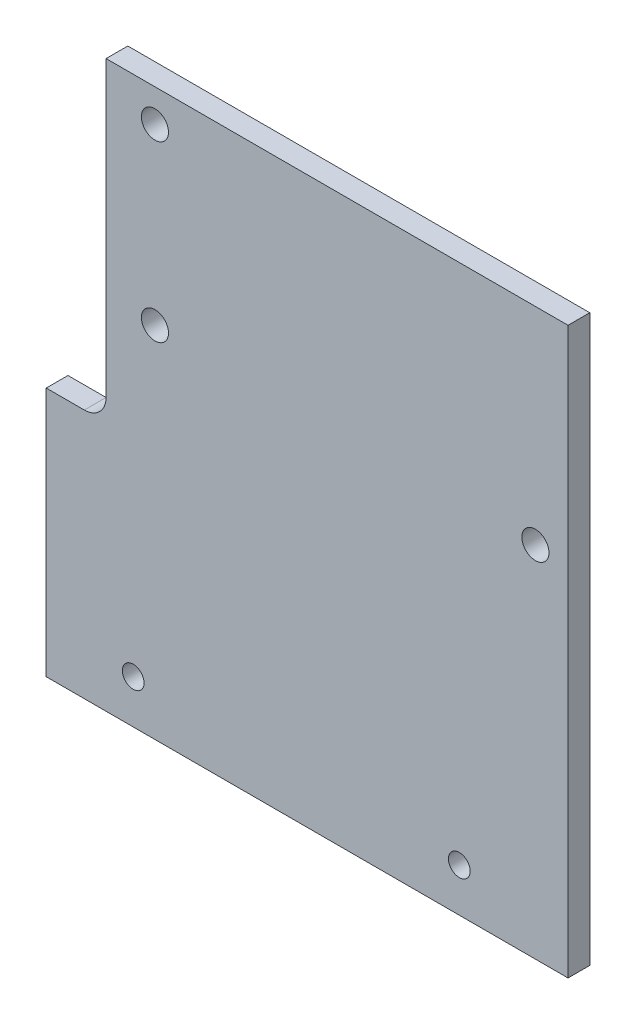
from build123d import *

# Parameters (mm, degrees)
SKETCH2_R           = 3.9624
SKETCH2_R_2         = 3.175
BOSS_EXTRUDE1_DEPTH = 6.35
FILLET1_R           = 6.35


with BuildPart() as part:
    # Sketch2 → Boss-Extrude1 (new body)
    with BuildSketch(Plane.XY):
        Polygon((152.4, 165.1), (17.4752, 165.1), (17.4752, 73.025), (0, 73.025), (0, 0), (152.4, 0), align=None)
        with Locations((31.75, 155.575)):
            Circle(SKETCH2_R, mode=Mode.SUBTRACT)
        with Locations((31.75, 104.775)):
            Circle(SKETCH2_R, mode=Mode.SUBTRACT)
        with Locations((142.875, 104.775)):
            Circle(SKETCH2_R, mode=Mode.SUBTRACT)
        with Locations((25.4, 12.7)):
            Circle(SKETCH2_R_2, mode=Mode.SUBTRACT)
        with Locations((120.65, 12.7)):
            Circle(SKETCH2_R_2, mode=Mode.SUBTRACT)
    extrude(amount=BOSS_EXTRUDE1_DEPTH)

    # Fillet1
    fillet1_edges = [part.edges().sort_by_distance(p)[0] for p in [
        (17.4752, 73.025, 3.175),
    ]]
    fillet(fillet1_edges, radius=FILLET1_R)


solid = part.part
